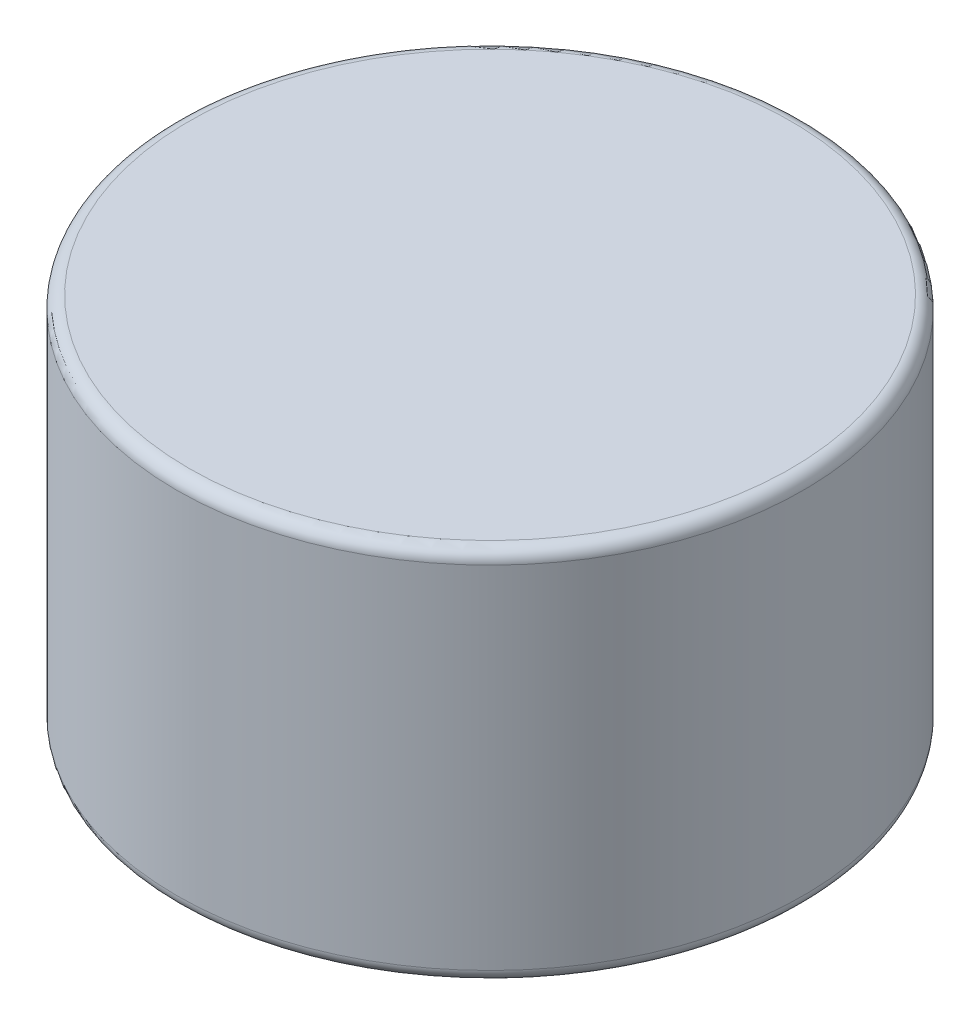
from build123d import *

# Parameters (mm, degrees)
SKETCH_1_R      = 2.5
EXTRUDE_1_DEPTH = 3
FILLET_1_R      = 0.1


with BuildPart() as part:
    # Sketch 1 → Extrude 1 (new body)
    with BuildSketch(Plane(origin=(0, 0, 0), x_dir=(1, 0, 0), z_dir=(0, 1, 0))):
        with Locations(Location((0, 0, 0), (0, 0, 270))):
            Circle(SKETCH_1_R)
    extrude(amount=EXTRUDE_1_DEPTH)

    # Fillet 1
    fillet_1_edges = [part.edges().sort_by_distance(p)[0] for p in [
        (0, 0, -2.5),
        (0, 3, -2.5),
    ]]
    fillet(fillet_1_edges, radius=FILLET_1_R)


solid = part.part
